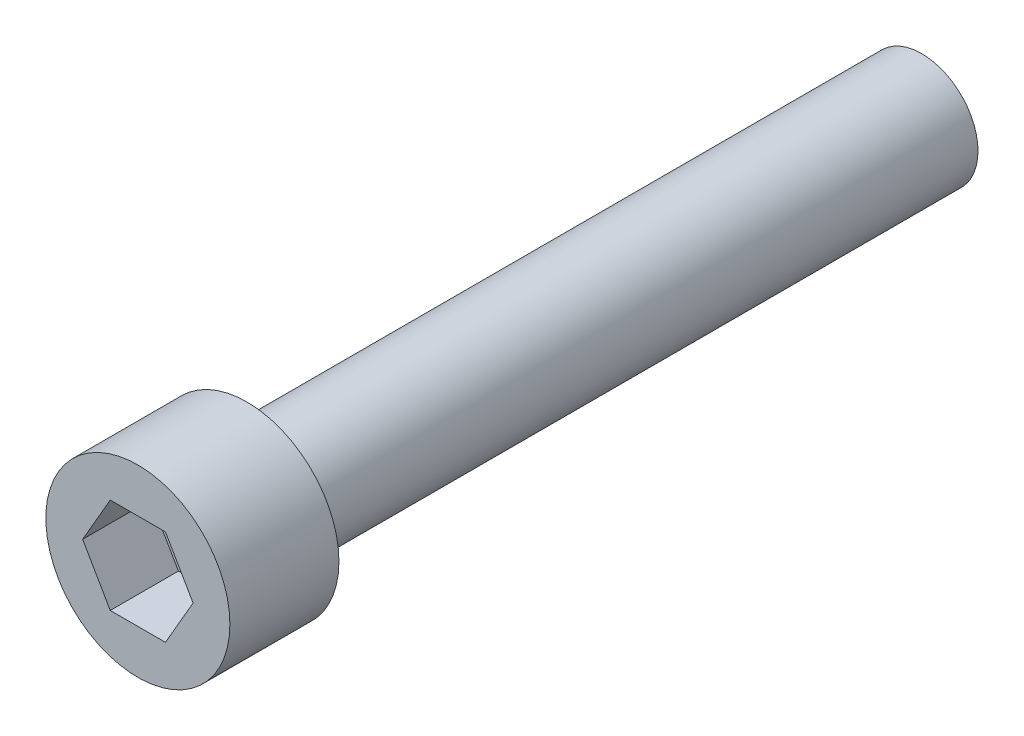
from build123d import *

# Parameters (mm, degrees)
SKETCH1_R           = 3.429
BOSS_EXTRUDE1_DEPTH = 4.064
SKETCH2_R           = 2.0955
BOSS_EXTRUDE2_DEPTH = 29.21
CUT_EXTRUDE1_DEPTH  = 2.54


with BuildPart() as part:
    # Sketch1 → Boss-Extrude1 (new body)
    with BuildSketch(Plane.XY):
        Circle(SKETCH1_R)
    extrude(amount=BOSS_EXTRUDE1_DEPTH)

    # Sketch2 → Boss-Extrude2 (add)
    with BuildSketch(Plane.XY.offset(4.064)):
        Circle(SKETCH2_R)
    extrude(amount=-BOSS_EXTRUDE2_DEPTH)

    # Sketch3 → Cut-Extrude1 (cut)
    with BuildSketch(Plane.XY.offset(4.064)):
        Polygon((2.0574, 0), (1.0287, 1.781760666), (-1.0287, 1.781760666), (-2.0574, 0), (-1.0287, -1.781760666), (1.0287, -1.781760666), align=None)
    extrude(amount=-CUT_EXTRUDE1_DEPTH, mode=Mode.SUBTRACT)


solid = part.part
